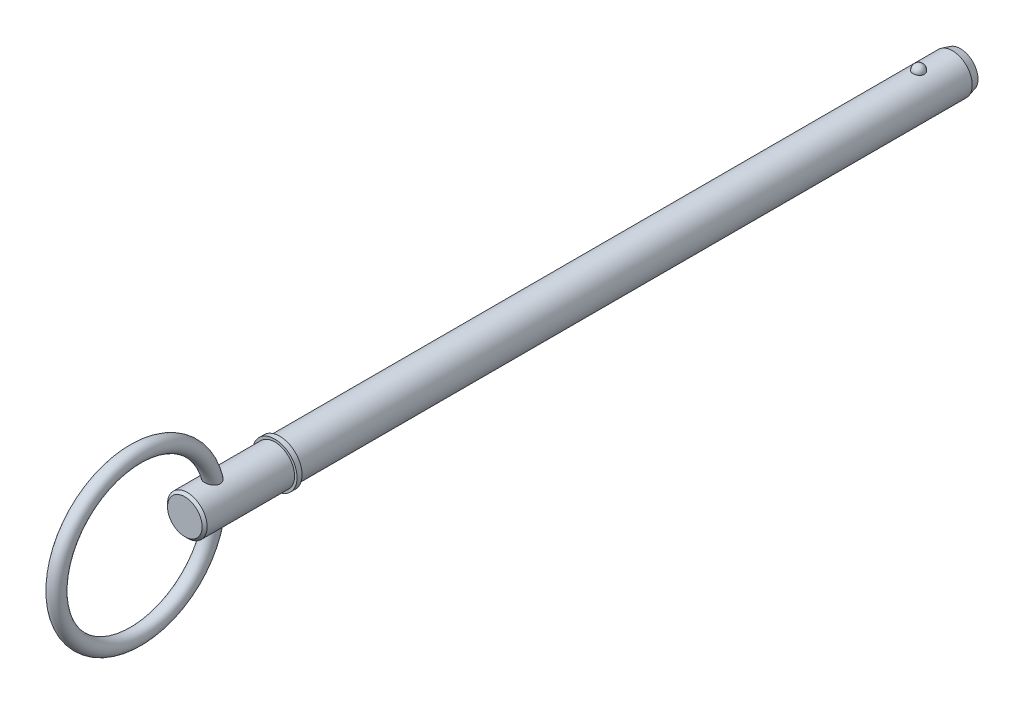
from build123d import *

# Parameters (mm, degrees)
SKETCH2_R           = 3.97
BOSS_EXTRUDE1_DEPTH = 127
BOSS_EXTRUDE2_START = 9.53
SKETCH3_R           = 3.97
BOSS_EXTRUDE2_DEPTH = 9.53
CHAMFER1_SIZE       = 1.586
CHAMFER1_SIZE2      = 0.424967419
SKETCH20_W          = 1
SKETCH20_H          = 4.47
SKETCH21_R          = 3.97
BOSS_EXTRUDE3_DEPTH = 19.05
CHAMFER2_SIZE       = 0.5
SKETCH24_R          = 1.5


with BuildPart() as part:
    # Sketch2 → Boss-Extrude1 (new body)
    with BuildSketch(Plane.XY):
        Circle(SKETCH2_R)
    extrude(amount=BOSS_EXTRUDE1_DEPTH)

    # Sketch3 → Boss-Extrude2 (add)
    with BuildSketch(Plane(origin=(0, 0, 0), x_dir=(-1, 0, 0), z_dir=(0, 0, -1)).offset(BOSS_EXTRUDE2_START)):
        Circle(SKETCH3_R)
    extrude(amount=-BOSS_EXTRUDE2_DEPTH)

    # Chamfer1
    chamfer1_edges = [part.edges().sort_by_distance(p)[0] for p in [
        (3.97, 0, -9.53),
    ]]
    chamfer1_side = [part.faces().sort_by_distance(p)[0] for p in [
        (3.97, 0, -4.765),
    ]]
    chamfer(chamfer1_edges, length=CHAMFER1_SIZE, length2=CHAMFER1_SIZE2, reference=chamfer1_side[0])

    # Sketch18 → Revolve1 (revolve)
    with BuildSketch(Plane(origin=(0, 0, 0), x_dir=(0, 0, -1), z_dir=(1, 0, 0))):
        with BuildLine():
            Line((1.15, 5.12), (1.15, 2.82))
            ThreePointArc((1.15, 2.82), (0, 3.97), (1.15, 5.12))
        make_face()
    revolve(axis=Axis((0, 5.12, -1.15), (0, -1, 0)))

    # Sketch20 → Revolve2 (revolve)
    with BuildSketch(Plane(origin=(0, 0, 0), x_dir=(0, 0, -1), z_dir=(1, 0, 0)), mode=Mode.PRIVATE) as revolve2_sk:
        with Locations((-127.5, 2.235)):
            Rectangle(SKETCH20_W, SKETCH20_H)
    revolve(revolve2_sk.sketch.rotate(Axis((0, 0, 33.728787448), (0, 0, 1)), 90), axis=Axis((0, 0, 33.728787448), (0, 0, 1)))

    # Sketch21 → Boss-Extrude3 (add)
    with BuildSketch(Plane(origin=(0, 0, 127), x_dir=(-1, 0, 0), z_dir=(0, 0, -1))):
        Circle(SKETCH21_R)
    extrude(amount=-BOSS_EXTRUDE3_DEPTH)

    # Chamfer2
    chamfer2_edges = [part.edges().sort_by_distance(p)[0] for p in [
        (3.97, 0, 146.05),
    ]]
    chamfer(chamfer2_edges, length=CHAMFER2_SIZE)

    # Sweep1: sweep along a path in Sketch23
    with BuildLine(Plane(origin=(0, 0, 0), x_dir=(0, 0, -1), z_dir=(1, 0, 0))) as sweep1_path:
        CenterArc((-155.925, 0), 15.875, 0, 360)
    # Sketch24 → Sweep1 (sweep)
    with BuildSketch(Plane(origin=(0, 0, 0), x_dir=(1, 0, 0), z_dir=(0, 1, 0))):
        with Locations((0, -140.05)):
            Circle(SKETCH24_R)
    sweep(path=sweep1_path.line)


solid = part.part
